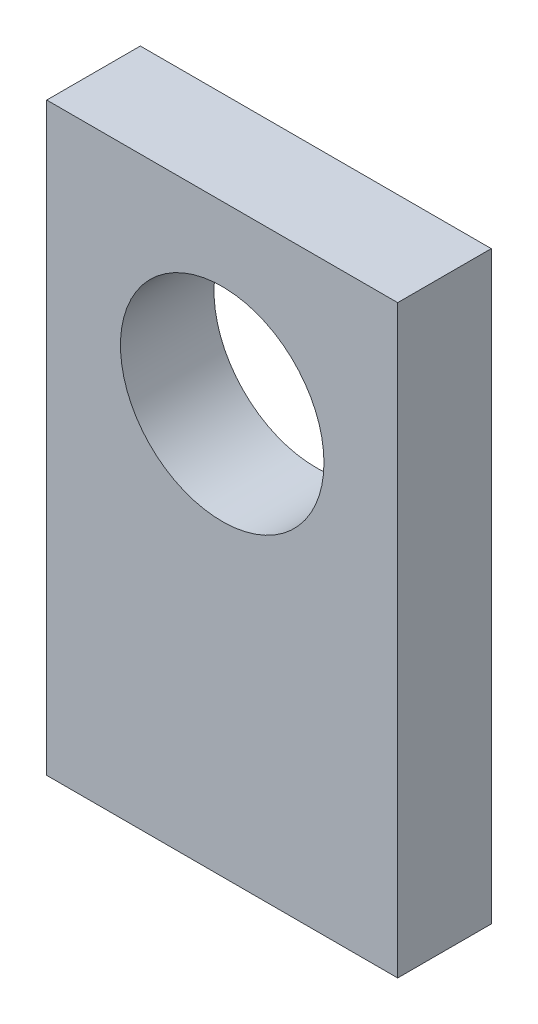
from build123d import *

# Parameters (mm, degrees)
SKETCH1_W      = 38.1
SKETCH1_H      = 63.5
SKETCH1_R      = 11.049
EXTRUDE1_DEPTH = 10.16


with BuildPart() as part:
    # Sketch1 → Extrude1 (new body)
    with BuildSketch(Plane.XY):
        with Locations((19.05, 31.75)):
            Rectangle(SKETCH1_W, SKETCH1_H)
        with Locations((19.05, 44.45)):
            Circle(SKETCH1_R, mode=Mode.SUBTRACT)
    extrude(amount=EXTRUDE1_DEPTH)


solid = part.part
